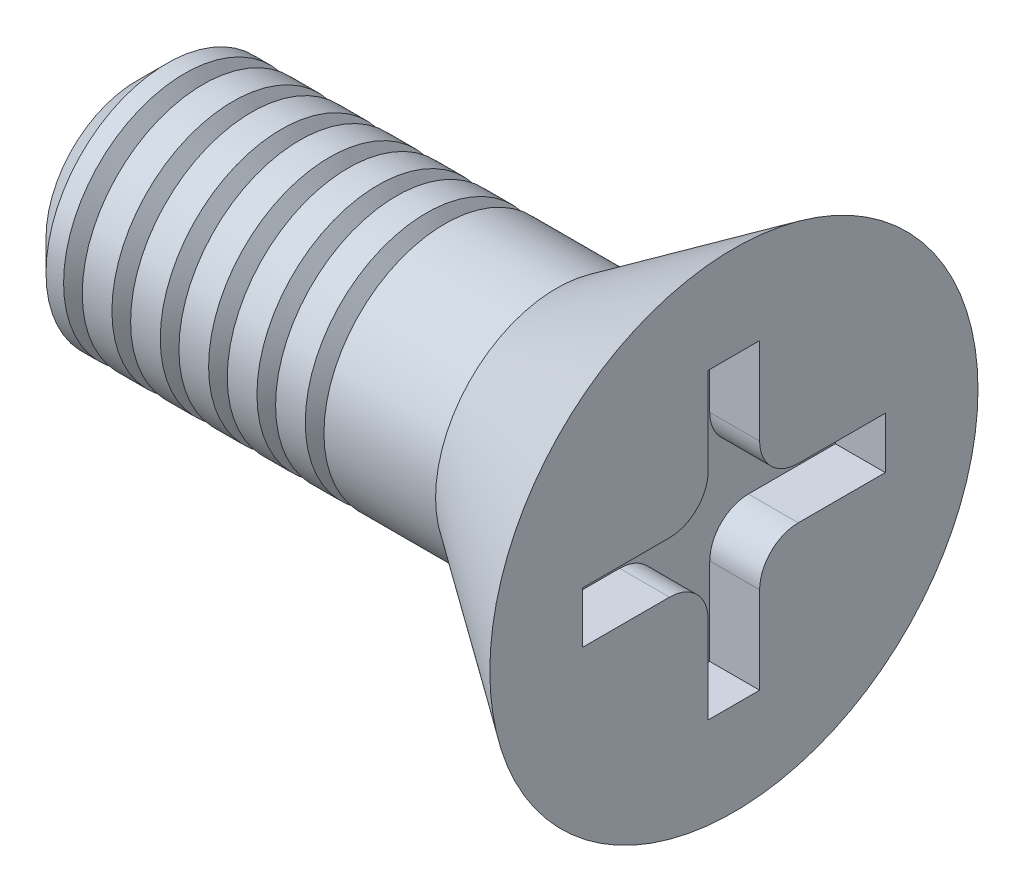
from build123d import *

# Parameters (mm, degrees)
BOSS_EXTRUDE1_START = 4.67106
SKETCH2_R           = 1.59004
BOSS_EXTRUDE1_DEPTH = 4.67106
CHAMFER1_SIZE       = 0.39878
CUT_EXTRUDE1_DEPTH  = 0.65532
FILLET1_R           = 0.508


with BuildPart() as part:
    # Sketch1 → Revolve1 (revolve)
    with BuildSketch(Plane.XY, mode=Mode.PRIVATE) as revolve1_sk:
        Polygon((3.175, 0), (3.175, 3.20675), (0.84582, 1.59004), (0, 1.59004), (0, 0), align=None)
    revolve(revolve1_sk.sketch.rotate(Axis((3.175, 0, 0), (-1, 0, 0)), 90), axis=Axis((3.175, 0, 0), (-1, 0, 0)))

    # Sketch2 → Boss-Extrude1 (add)
    with BuildSketch(Plane.ZY.offset(BOSS_EXTRUDE1_START)):
        with Locations(Location((0, 0, 0), (0, 0, 180))):
            Circle(SKETCH2_R)
    extrude(amount=-BOSS_EXTRUDE1_DEPTH)

    # Chamfer1
    chamfer1_edges = [part.edges().sort_by_distance(p)[0] for p in [
        (-4.67106, 0, 1.59004),
    ]]
    chamfer(chamfer1_edges, length=CHAMFER1_SIZE)

    # Sketch3 → Cut-Extrude1 (cut)
    with BuildSketch(Plane(origin=(3.175, 0, 0), x_dir=(0, 0, -1), z_dir=(1, 0, 0))):
        Polygon((-0.33782, 1.98882), (-0.33782, 0.33782), (-1.98882, 0.33782), (-1.98882, -0.33782), (-0.33782, -0.33782), (-0.33782, -1.98882), (0.33782, -1.98882), (0.33782, -0.33782), (1.98882, -0.33782), (1.98882, 0.33782), (0.33782, 0.33782), (0.33782, 1.98882), align=None)
    extrude(amount=-CUT_EXTRUDE1_DEPTH, mode=Mode.SUBTRACT)

    # Fillet1
    fillet1_edges = [part.edges().sort_by_distance(p)[0] for p in [
        (2.84734, 0.33782, -0.33782),
        (2.84734, -0.33782, -0.33782),
        (2.84734, -0.33782, 0.33782),
        (2.84734, 0.33782, 0.33782),
    ]]
    fillet(fillet1_edges, radius=FILLET1_R)

    # Sketch4 → Cut-Revolve1 (revolve, cut)
    with BuildSketch(Plane.XY, mode=Mode.PRIVATE) as cut_revolve1_sk:
        Polygon((-4.199774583, 1.842822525), (-3.91747902, 1.39265805), (-3.640315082, 1.842822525), align=None)
        Polygon((-3.564774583, 1.842822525), (-3.28247902, 1.39265805), (-3.005315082, 1.842822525), align=None)
        Polygon((-2.929774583, 1.842822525), (-2.64747902, 1.39265805), (-2.370315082, 1.842822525), align=None)
        Polygon((-2.294774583, 1.842822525), (-2.01247902, 1.39265805), (-1.735315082, 1.842822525), align=None)
        Polygon((-1.659774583, 1.842822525), (-1.37747902, 1.39265805), (-1.100315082, 1.842822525), align=None)
        Polygon((-1.024774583, 1.842822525), (-0.74247902, 1.39265805), (-0.465315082, 1.842822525), align=None)
    revolve(cut_revolve1_sk.sketch.rotate(Axis((-4.27228, 0, 0), (1, 0, 0)), 270), axis=Axis((-4.27228, 0, 0), (1, 0, 0)), mode=Mode.SUBTRACT)


solid = part.part
